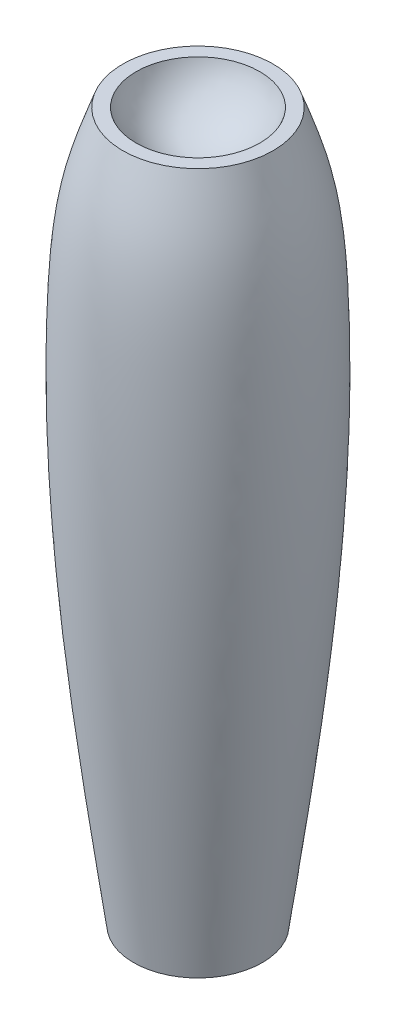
ISO-10303-21;
HEADER;
FILE_DESCRIPTION(('STEP AP214'),'2;1');
FILE_NAME('part.step','',(''),(''),'','','');
FILE_SCHEMA(('AUTOMOTIVE_DESIGN { 1 0 10303 214 1 1 1 1 }'));
ENDSEC;
DATA;
#1=APPLICATION_CONTEXT('core data for automotive mechanical design processes');
#2=APPLICATION_PROTOCOL_DEFINITION('international standard','automotive_design',2000,#1);
#3=PRODUCT_CONTEXT('',#1,'mechanical');
#4=PRODUCT('Part','Part','',(#3));
#5=PRODUCT_RELATED_PRODUCT_CATEGORY('part','',(#4));
#6=PRODUCT_DEFINITION_FORMATION('','',#4);
#7=PRODUCT_DEFINITION_CONTEXT('part definition',#1,'design');
#8=PRODUCT_DEFINITION('design','',#6,#7);
#9=PRODUCT_DEFINITION_SHAPE('','',#8);
#10=(LENGTH_UNIT() NAMED_UNIT(*) SI_UNIT(.MILLI.,.METRE.));
#11=(NAMED_UNIT(*) PLANE_ANGLE_UNIT() SI_UNIT($,.RADIAN.));
#12=(NAMED_UNIT(*) SI_UNIT($,.STERADIAN.) SOLID_ANGLE_UNIT());
#13=UNCERTAINTY_MEASURE_WITH_UNIT(LENGTH_MEASURE(1.E-05),#10,'distance_accuracy_value','');
#14=(GEOMETRIC_REPRESENTATION_CONTEXT(3) GLOBAL_UNCERTAINTY_ASSIGNED_CONTEXT((#13)) GLOBAL_UNIT_ASSIGNED_CONTEXT((#10,
#11,#12)) REPRESENTATION_CONTEXT('',''));
#15=CARTESIAN_POINT('',(0.,0.,0.));
#16=DIRECTION('',(0.,0.,1.));
#17=DIRECTION('',(1.,0.,0.));
#18=AXIS2_PLACEMENT_3D('',#15,#16,#17);
#19=CARTESIAN_POINT('',(-36.,0.,0.));
#20=DIRECTION('',(0.,1.,0.));
#21=DIRECTION('',(-1.,0.,0.));
#22=AXIS2_PLACEMENT_3D('',#19,#20,#21);
#23=PLANE('',#22);
#24=CARTESIAN_POINT('',(0.,0.,0.));
#25=DIRECTION('',(0.,-1.,0.));
#26=DIRECTION('',(1.,0.,0.));
#27=AXIS2_PLACEMENT_3D('',#24,#25,#26);
#28=CIRCLE('',#27,36.);
#29=CARTESIAN_POINT('',(36.,0.,0.));
#30=VERTEX_POINT('',#29);
#31=EDGE_CURVE('E43',#30,#30,#28,.T.);
#32=ORIENTED_EDGE('',*,*,#31,.T.);
#33=EDGE_LOOP('',(#32));
#34=FACE_BOUND('',#33,.T.);
#35=CARTESIAN_POINT('',(0.,0.,0.));
#36=DIRECTION('',(0.,1.,0.));
#37=DIRECTION('',(-1.,0.,0.));
#38=AXIS2_PLACEMENT_3D('',#35,#36,#37);
#39=CIRCLE('',#38,25.0798724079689);
#40=CARTESIAN_POINT('',(-25.0798724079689,0.,0.));
#41=VERTEX_POINT('',#40);
#42=EDGE_CURVE('E39',#41,#41,#39,.F.);
#43=ORIENTED_EDGE('',*,*,#42,.F.);
#44=EDGE_LOOP('',(#43));
#45=FACE_BOUND('',#44,.T.);
#46=ADVANCED_FACE('F34',(#34,#45),#23,.F.);
#47=CARTESIAN_POINT('',(-42.,396.,0.));
#48=CARTESIAN_POINT('',(-46.0371137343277,384.695047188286,0.));
#49=CARTESIAN_POINT('',(-56.7334095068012,354.742678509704,0.));
#50=CARTESIAN_POINT('',(-62.4741178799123,266.82504438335,0.));
#51=CARTESIAN_POINT('',(-55.8641090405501,145.937594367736,0.));
#52=CARTESIAN_POINT('',(-42.1829397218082,45.4248084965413,0.));
#53=CARTESIAN_POINT('',(-36.,0.,0.));
#54=B_SPLINE_CURVE_WITH_KNOTS('',3,(#47,#48,#49,#50,#51,#52,#53),.UNSPECIFIED.,.F.,.F.,(4,1,1,1,
4),(0.,0.0898913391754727,0.238166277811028,0.655703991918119,1.),.UNSPECIFIED.);
#55=CARTESIAN_POINT('',(0.,0.,0.));
#56=DIRECTION('',(0.,-1.,0.));
#57=AXIS1_PLACEMENT('',#55,#56);
#58=SURFACE_OF_REVOLUTION('',#54,#57);
#59=ORIENTED_EDGE('',*,*,#31,.F.);
#60=EDGE_LOOP('',(#59));
#61=FACE_BOUND('',#60,.T.);
#62=CARTESIAN_POINT('',(0.,396.,0.));
#63=DIRECTION('',(0.,-1.,0.));
#64=DIRECTION('',(1.,0.,0.));
#65=AXIS2_PLACEMENT_3D('',#62,#63,#64);
#66=CIRCLE('',#65,42.);
#67=CARTESIAN_POINT('',(42.,396.,0.));
#68=VERTEX_POINT('',#67);
#69=EDGE_CURVE('E10',#68,#68,#66,.T.);
#70=ORIENTED_EDGE('',*,*,#69,.T.);
#71=EDGE_LOOP('',(#70));
#72=FACE_BOUND('',#71,.T.);
#73=ADVANCED_FACE('F36',(#61,#72),#58,.T.);
#74=CARTESIAN_POINT('',(0.,396.,0.));
#75=DIRECTION('',(0.,-1.,0.));
#76=DIRECTION('',(1.,0.,0.));
#77=AXIS2_PLACEMENT_3D('',#74,#75,#76);
#78=PLANE('',#77);
#79=CARTESIAN_POINT('',(0.,396.,0.));
#80=DIRECTION('',(0.,-1.,0.));
#81=DIRECTION('',(1.,0.,0.));
#82=AXIS2_PLACEMENT_3D('',#79,#80,#81);
#83=CIRCLE('',#82,34.5832329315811);
#84=CARTESIAN_POINT('',(34.5832329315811,396.,0.));
#85=VERTEX_POINT('',#84);
#86=EDGE_CURVE('E48',#85,#85,#83,.T.);
#87=ORIENTED_EDGE('',*,*,#86,.T.);
#88=EDGE_LOOP('',(#87));
#89=FACE_BOUND('',#88,.T.);
#90=ORIENTED_EDGE('',*,*,#69,.F.);
#91=EDGE_LOOP('',(#90));
#92=FACE_BOUND('',#91,.T.);
#93=ADVANCED_FACE('F64',(#89,#92),#78,.F.);
#94=CARTESIAN_POINT('',(0.,406.,0.));
#95=DIRECTION('',(0.,-1.,0.));
#96=DIRECTION('',(-1.,0.,0.));
#97=AXIS2_PLACEMENT_3D('',#94,#95,#96);
#98=SPHERICAL_SURFACE('',#97,36.);
#99=ORIENTED_EDGE('',*,*,#86,.F.);
#100=EDGE_LOOP('',(#99));
#101=FACE_BOUND('',#100,.T.);
#102=ADVANCED_FACE('F67',(#101),#98,.F.);
#103=CARTESIAN_POINT('',(0.,-10.,0.));
#104=DIRECTION('',(0.,-1.,0.));
#105=DIRECTION('',(-1.,0.,0.));
#106=AXIS2_PLACEMENT_3D('',#103,#104,#105);
#107=SPHERICAL_SURFACE('',#106,27.);
#108=ORIENTED_EDGE('',*,*,#42,.T.);
#109=EDGE_LOOP('',(#108));
#110=FACE_BOUND('',#109,.T.);
#111=ADVANCED_FACE('F56',(#110),#107,.F.);
#112=CLOSED_SHELL('',(#46,#73,#93,#102,#111));
#113=MANIFOLD_SOLID_BREP('B2',#112);
#114=ADVANCED_BREP_SHAPE_REPRESENTATION('',(#18,#113),#14);
#115=SHAPE_DEFINITION_REPRESENTATION(#9,#114);
ENDSEC;
END-ISO-10303-21;
